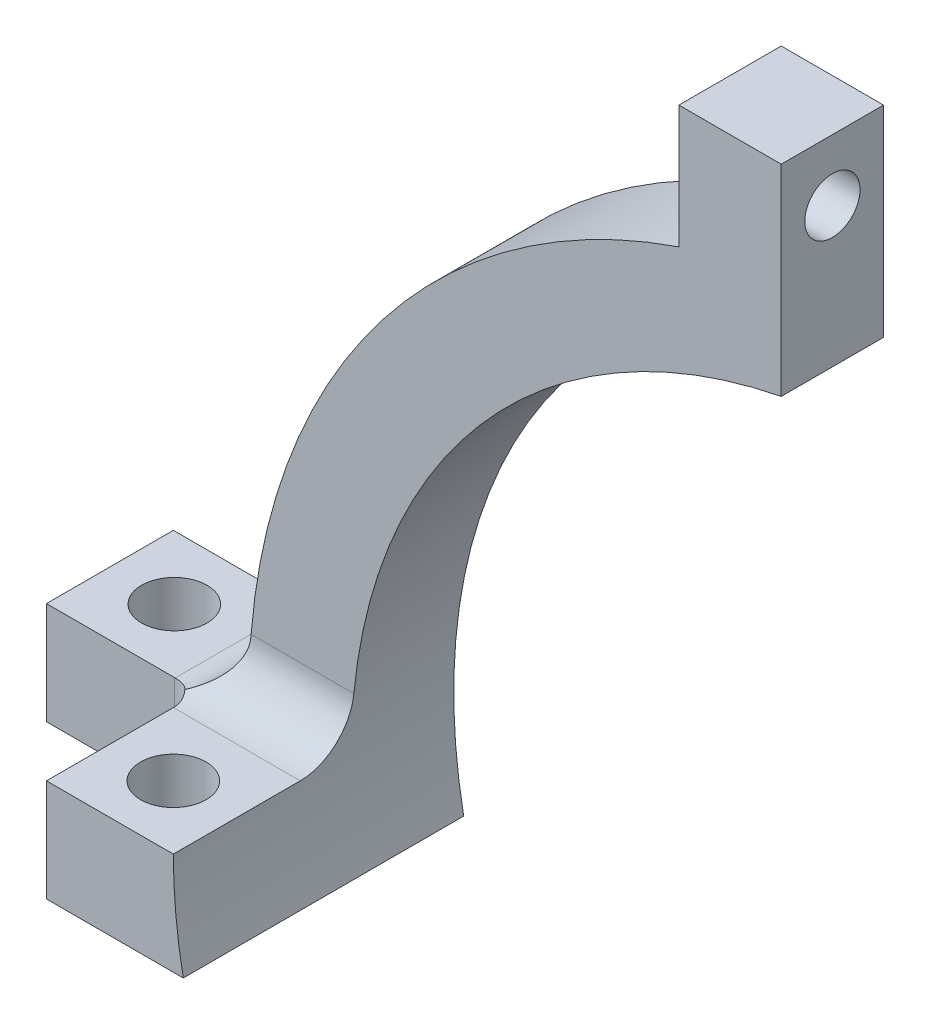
ISO-10303-21;
HEADER;
FILE_DESCRIPTION(('STEP AP214'),'2;1');
FILE_NAME('part.step','',(''),(''),'','','');
FILE_SCHEMA(('AUTOMOTIVE_DESIGN { 1 0 10303 214 1 1 1 1 }'));
ENDSEC;
DATA;
#1=APPLICATION_CONTEXT('core data for automotive mechanical design processes');
#2=APPLICATION_PROTOCOL_DEFINITION('international standard','automotive_design',2000,#1);
#3=PRODUCT_CONTEXT('',#1,'mechanical');
#4=PRODUCT('Part','Part','',(#3));
#5=PRODUCT_RELATED_PRODUCT_CATEGORY('part','',(#4));
#6=PRODUCT_DEFINITION_FORMATION('','',#4);
#7=PRODUCT_DEFINITION_CONTEXT('part definition',#1,'design');
#8=PRODUCT_DEFINITION('design','',#6,#7);
#9=PRODUCT_DEFINITION_SHAPE('','',#8);
#10=(LENGTH_UNIT() NAMED_UNIT(*) SI_UNIT(.MILLI.,.METRE.));
#11=(NAMED_UNIT(*) PLANE_ANGLE_UNIT() SI_UNIT($,.RADIAN.));
#12=(NAMED_UNIT(*) SI_UNIT($,.STERADIAN.) SOLID_ANGLE_UNIT());
#13=UNCERTAINTY_MEASURE_WITH_UNIT(LENGTH_MEASURE(1.E-05),#10,'distance_accuracy_value','');
#14=(GEOMETRIC_REPRESENTATION_CONTEXT(3) GLOBAL_UNCERTAINTY_ASSIGNED_CONTEXT((#13)) GLOBAL_UNIT_ASSIGNED_CONTEXT((#10,
#11,#12)) REPRESENTATION_CONTEXT('',''));
#15=CARTESIAN_POINT('',(0.,0.,0.));
#16=DIRECTION('',(0.,0.,1.));
#17=DIRECTION('',(1.,0.,0.));
#18=AXIS2_PLACEMENT_3D('',#15,#16,#17);
#19=CARTESIAN_POINT('',(-8.7,5.,1.2));
#20=DIRECTION('',(0.,-1.,0.));
#21=DIRECTION('',(1.,0.,0.));
#22=AXIS2_PLACEMENT_3D('',#19,#20,#21);
#23=PLANE('',#22);
#24=CARTESIAN_POINT('',(1.9,5.,5.6));
#25=DIRECTION('',(0.,-1.,0.));
#26=DIRECTION('',(-1.,0.,0.));
#27=AXIS2_PLACEMENT_3D('',#24,#25,#26);
#28=CIRCLE('',#27,1.6);
#29=CARTESIAN_POINT('',(0.3,5.,5.6));
#30=VERTEX_POINT('',#29);
#31=EDGE_CURVE('E515',#30,#30,#28,.T.);
#32=ORIENTED_EDGE('',*,*,#31,.T.);
#33=EDGE_LOOP('',(#32));
#34=FACE_BOUND('',#33,.T.);
#35=DIRECTION('',(0.,0.,-1.));
#36=VECTOR('',#35,1.);
#37=CARTESIAN_POINT('',(-1.2,5.,8.7));
#38=LINE('',#37,#36);
#39=CARTESIAN_POINT('',(-1.2,5.,8.7));
#40=VERTEX_POINT('',#39);
#41=CARTESIAN_POINT('',(-1.2,5.,2.5));
#42=VERTEX_POINT('',#41);
#43=EDGE_CURVE('E174',#40,#42,#38,.T.);
#44=ORIENTED_EDGE('',*,*,#43,.F.);
#45=DIRECTION('',(-1.,0.,0.));
#46=VECTOR('',#45,1.);
#47=CARTESIAN_POINT('',(5.,5.,8.7));
#48=LINE('',#47,#46);
#49=CARTESIAN_POINT('',(5.,5.,8.7));
#50=VERTEX_POINT('',#49);
#51=EDGE_CURVE('E147',#50,#40,#48,.T.);
#52=ORIENTED_EDGE('',*,*,#51,.F.);
#53=DIRECTION('',(0.,0.,-1.));
#54=VECTOR('',#53,1.);
#55=CARTESIAN_POINT('',(5.,5.,8.7));
#56=LINE('',#55,#54);
#57=CARTESIAN_POINT('',(5.,5.,2.5));
#58=VERTEX_POINT('',#57);
#59=EDGE_CURVE('E161',#50,#58,#56,.T.);
#60=ORIENTED_EDGE('',*,*,#59,.T.);
#61=DIRECTION('',(-1.,0.,0.));
#62=VECTOR('',#61,1.);
#63=CARTESIAN_POINT('',(5.,5.,2.5));
#64=LINE('',#63,#62);
#65=EDGE_CURVE('E246',#42,#58,#64,.F.);
#66=ORIENTED_EDGE('',*,*,#65,.F.);
#67=EDGE_LOOP('',(#44,#52,#60,#66));
#68=FACE_BOUND('',#67,.T.);
#69=ADVANCED_FACE('F35',(#34,#68),#23,.F.);
#70=CARTESIAN_POINT('',(5.48529835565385,0.,-5.));
#71=DIRECTION('',(0.,1.,0.));
#72=DIRECTION('',(0.,0.,-1.));
#73=AXIS2_PLACEMENT_3D('',#70,#71,#72);
#74=PLANE('',#73);
#75=CARTESIAN_POINT('',(-5.55329308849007,0.,-1.9));
#76=DIRECTION('',(0.,-1.,0.));
#77=DIRECTION('',(0.,0.,-1.));
#78=AXIS2_PLACEMENT_3D('',#75,#76,#77);
#79=CIRCLE('',#78,1.6);
#80=CARTESIAN_POINT('',(-5.55329308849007,0.,-3.5));
#81=VERTEX_POINT('',#80);
#82=EDGE_CURVE('E521',#81,#81,#79,.F.);
#83=ORIENTED_EDGE('',*,*,#82,.T.);
#84=EDGE_LOOP('',(#83));
#85=FACE_BOUND('',#84,.T.);
#86=CARTESIAN_POINT('',(1.9,0.,5.6));
#87=DIRECTION('',(0.,-1.,0.));
#88=DIRECTION('',(0.,0.,-1.));
#89=AXIS2_PLACEMENT_3D('',#86,#87,#88);
#90=CIRCLE('',#89,1.6);
#91=CARTESIAN_POINT('',(1.9,0.,4.));
#92=VERTEX_POINT('',#91);
#93=EDGE_CURVE('E518',#92,#92,#90,.F.);
#94=ORIENTED_EDGE('',*,*,#93,.T.);
#95=EDGE_LOOP('',(#94));
#96=FACE_BOUND('',#95,.T.);
#97=DIRECTION('',(1.,0.,0.));
#98=VECTOR('',#97,1.);
#99=CARTESIAN_POINT('',(-8.7,0.,1.2));
#100=LINE('',#99,#98);
#101=CARTESIAN_POINT('',(-8.7,0.,1.2));
#102=VERTEX_POINT('',#101);
#103=CARTESIAN_POINT('',(-2.45,0.,1.2));
#104=VERTEX_POINT('',#103);
#105=EDGE_CURVE('E194',#102,#104,#100,.T.);
#106=ORIENTED_EDGE('',*,*,#105,.F.);
#107=DIRECTION('',(0.,0.,-1.));
#108=VECTOR('',#107,1.);
#109=CARTESIAN_POINT('',(-8.7,0.,1.2));
#110=LINE('',#109,#108);
#111=CARTESIAN_POINT('',(-8.7,0.,-5.));
#112=VERTEX_POINT('',#111);
#113=EDGE_CURVE('E180',#102,#112,#110,.T.);
#114=ORIENTED_EDGE('',*,*,#113,.T.);
#115=DIRECTION('',(1.,0.,0.));
#116=VECTOR('',#115,1.);
#117=CARTESIAN_POINT('',(5.48529835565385,0.,-5.));
#118=LINE('',#117,#116);
#119=CARTESIAN_POINT('',(5.48529835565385,0.,-5.));
#120=VERTEX_POINT('',#119);
#121=EDGE_CURVE('E198',#112,#120,#118,.T.);
#122=ORIENTED_EDGE('',*,*,#121,.T.);
#123=DIRECTION('',(0.,0.,1.));
#124=VECTOR('',#123,1.);
#125=CARTESIAN_POINT('',(5.48529835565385,0.,-5.));
#126=LINE('',#125,#124);
#127=CARTESIAN_POINT('',(5.48529835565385,0.,8.7));
#128=VERTEX_POINT('',#127);
#129=EDGE_CURVE('E167',#120,#128,#126,.T.);
#130=ORIENTED_EDGE('',*,*,#129,.T.);
#131=DIRECTION('',(1.,0.,0.));
#132=VECTOR('',#131,1.);
#133=CARTESIAN_POINT('',(-1.2,0.,8.7));
#134=LINE('',#133,#132);
#135=CARTESIAN_POINT('',(-1.2,0.,8.7));
#136=VERTEX_POINT('',#135);
#137=EDGE_CURVE('E144',#136,#128,#134,.T.);
#138=ORIENTED_EDGE('',*,*,#137,.F.);
#139=DIRECTION('',(0.,0.,-1.));
#140=VECTOR('',#139,1.);
#141=CARTESIAN_POINT('',(-1.2,0.,8.7));
#142=LINE('',#141,#140);
#143=CARTESIAN_POINT('',(-1.2,0.,2.45));
#144=VERTEX_POINT('',#143);
#145=EDGE_CURVE('E154',#136,#144,#142,.T.);
#146=ORIENTED_EDGE('',*,*,#145,.T.);
#147=CARTESIAN_POINT('',(-2.45,0.,2.45));
#148=DIRECTION('',(0.,-1.,0.));
#149=DIRECTION('',(0.,0.,-1.));
#150=AXIS2_PLACEMENT_3D('',#147,#148,#149);
#151=CIRCLE('',#150,1.25);
#152=EDGE_CURVE('E304',#104,#144,#151,.T.);
#153=ORIENTED_EDGE('',*,*,#152,.F.);
#154=EDGE_LOOP('',(#106,#114,#122,#130,#138,#146,#153));
#155=FACE_BOUND('',#154,.T.);
#156=ADVANCED_FACE('F164',(#85,#96,#155),#74,.F.);
#157=CARTESIAN_POINT('',(31.,5.,-5.));
#158=DIRECTION('',(0.,0.,1.));
#159=DIRECTION('',(-1.,0.,0.));
#160=AXIS2_PLACEMENT_3D('',#157,#158,#159);
#161=CYLINDRICAL_SURFACE('',#160,26.);
#162=ORIENTED_EDGE('',*,*,#129,.F.);
#163=CARTESIAN_POINT('',(31.,5.,-5.));
#164=DIRECTION('',(0.,0.,-1.));
#165=DIRECTION('',(1.,0.,0.));
#166=AXIS2_PLACEMENT_3D('',#163,#164,#165);
#167=CIRCLE('',#166,26.);
#168=CARTESIAN_POINT('',(26.,30.5147016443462,-5.));
#169=VERTEX_POINT('',#168);
#170=EDGE_CURVE('E200',#120,#169,#167,.T.);
#171=ORIENTED_EDGE('',*,*,#170,.T.);
#172=DIRECTION('',(0.,0.,1.));
#173=VECTOR('',#172,1.);
#174=CARTESIAN_POINT('',(26.,30.5147016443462,-5.));
#175=LINE('',#174,#173);
#176=CARTESIAN_POINT('',(26.,30.5147016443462,0.));
#177=VERTEX_POINT('',#176);
#178=EDGE_CURVE('E238',#169,#177,#175,.T.);
#179=ORIENTED_EDGE('',*,*,#178,.T.);
#180=CARTESIAN_POINT('',(31.,5.,0.));
#181=DIRECTION('',(0.,0.,-1.));
#182=DIRECTION('',(1.,0.,0.));
#183=AXIS2_PLACEMENT_3D('',#180,#181,#182);
#184=CIRCLE('',#183,26.);
#185=CARTESIAN_POINT('',(5.12047141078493,7.5,0.));
#186=VERTEX_POINT('',#185);
#187=EDGE_CURVE('E197',#186,#177,#184,.T.);
#188=ORIENTED_EDGE('',*,*,#187,.F.);
#189=CARTESIAN_POINT('',(5.,5.,2.5));
#190=CARTESIAN_POINT('',(5.00000212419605,4.99999326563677,2.42968988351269));
#191=CARTESIAN_POINT('',(5.00000005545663,5.00296608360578,2.35938296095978));
#192=CARTESIAN_POINT('',(5.00000298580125,5.0148187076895,2.21927203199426));
#193=CARTESIAN_POINT('',(5.00000798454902,5.02369823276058,2.14946800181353));
#194=CARTESIAN_POINT('',(5.00004048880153,5.04730343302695,2.01090385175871));
#195=CARTESIAN_POINT('',(5.00006797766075,5.06202478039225,1.94214299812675));
#196=CARTESIAN_POINT('',(5.00017577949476,5.09719420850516,1.80612252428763));
#197=CARTESIAN_POINT('',(5.00025609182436,5.11764221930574,1.73886288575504));
#198=CARTESIAN_POINT('',(5.00063315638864,5.1874113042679,1.53998405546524));
#199=CARTESIAN_POINT('',(5.00106599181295,5.24516696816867,1.41120926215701));
#200=CARTESIAN_POINT('',(5.002709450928,5.38143641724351,1.16528046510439));
#201=CARTESIAN_POINT('',(5.00391993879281,5.45994657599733,1.04812443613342));
#202=CARTESIAN_POINT('',(5.0076193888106,5.63547888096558,0.828688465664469));
#203=CARTESIAN_POINT('',(5.01010784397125,5.73249367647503,0.726402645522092));
#204=CARTESIAN_POINT('',(5.01686943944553,5.94229278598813,0.539570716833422));
#205=CARTESIAN_POINT('',(5.02114285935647,6.05507956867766,0.455027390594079));
#206=CARTESIAN_POINT('',(5.03189730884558,6.29297586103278,0.306200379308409));
#207=CARTESIAN_POINT('',(5.0383751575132,6.41806743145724,0.241887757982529));
#208=CARTESIAN_POINT('',(5.05382240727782,6.67709758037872,0.135169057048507));
#209=CARTESIAN_POINT('',(5.06279050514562,6.8110315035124,0.0927515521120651));
#210=CARTESIAN_POINT('',(5.07984743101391,7.03813387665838,0.041269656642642));
#211=CARTESIAN_POINT('',(5.08722724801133,7.12995549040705,0.0257950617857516));
#212=CARTESIAN_POINT('',(5.10305733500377,7.31452290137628,0.00516119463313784));
#213=CARTESIAN_POINT('',(5.11150602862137,7.40726715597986,-1.30842178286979E-05));
#214=CARTESIAN_POINT('',(5.12047141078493,7.5,0.));
#215=B_SPLINE_CURVE_WITH_KNOTS('',3,(#189,#190,#191,#192,#193,#194,#195,#196,#197,#198,#199,
#200,#201,#202,#203,#204,#205,#206,#207,#208,#209,#210,#211,#212,#213,#214),.UNSPECIFIED.,.F.,
.F.,(4,2,2,2,2,2,2,2,2,2,2,2,4),(0.,0.210861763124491,0.421713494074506,0.632409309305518,
0.843102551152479,1.26432167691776,1.68546725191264,2.10644587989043,2.52749047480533,
2.94793007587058,3.36815006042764,3.64783239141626,3.92710695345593),.UNSPECIFIED.);
#216=EDGE_CURVE('E290',#58,#186,#215,.T.);
#217=ORIENTED_EDGE('',*,*,#216,.F.);
#218=ORIENTED_EDGE('',*,*,#59,.F.);
#219=CARTESIAN_POINT('',(31.,5.,8.7));
#220=DIRECTION('',(0.,0.,-1.));
#221=DIRECTION('',(1.,0.,0.));
#222=AXIS2_PLACEMENT_3D('',#219,#220,#221);
#223=CIRCLE('',#222,26.);
#224=EDGE_CURVE('E168',#128,#50,#223,.T.);
#225=ORIENTED_EDGE('',*,*,#224,.F.);
#226=EDGE_LOOP('',(#162,#171,#179,#188,#217,#218,#225));
#227=FACE_BOUND('',#226,.T.);
#228=ADVANCED_FACE('F285',(#227),#161,.F.);
#229=CARTESIAN_POINT('',(26.,40.3428015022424,-5.));
#230=DIRECTION('',(-1.,0.,0.));
#231=DIRECTION('',(0.,-1.,0.));
#232=AXIS2_PLACEMENT_3D('',#229,#230,#231);
#233=PLANE('',#232);
#234=CARTESIAN_POINT('',(26.,37.3428015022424,-2.5));
#235=DIRECTION('',(1.,0.,0.));
#236=DIRECTION('',(0.,-1.,0.));
#237=AXIS2_PLACEMENT_3D('',#234,#235,#236);
#238=CIRCLE('',#237,1.35);
#239=CARTESIAN_POINT('',(26.,35.9928015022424,-2.5));
#240=VERTEX_POINT('',#239);
#241=EDGE_CURVE('E301',#240,#240,#238,.F.);
#242=ORIENTED_EDGE('',*,*,#241,.T.);
#243=EDGE_LOOP('',(#242));
#244=FACE_BOUND('',#243,.T.);
#245=DIRECTION('',(0.,1.,0.));
#246=VECTOR('',#245,1.);
#247=CARTESIAN_POINT('',(26.,40.3428015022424,0.));
#248=LINE('',#247,#246);
#249=CARTESIAN_POINT('',(26.,40.3428015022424,0.));
#250=VERTEX_POINT('',#249);
#251=EDGE_CURVE('E219',#177,#250,#248,.T.);
#252=ORIENTED_EDGE('',*,*,#251,.F.);
#253=ORIENTED_EDGE('',*,*,#178,.F.);
#254=DIRECTION('',(0.,1.,0.));
#255=VECTOR('',#254,1.);
#256=CARTESIAN_POINT('',(26.,40.3428015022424,-5.));
#257=LINE('',#256,#255);
#258=CARTESIAN_POINT('',(26.,40.3428015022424,-5.));
#259=VERTEX_POINT('',#258);
#260=EDGE_CURVE('E204',#169,#259,#257,.T.);
#261=ORIENTED_EDGE('',*,*,#260,.T.);
#262=DIRECTION('',(0.,0.,1.));
#263=VECTOR('',#262,1.);
#264=CARTESIAN_POINT('',(26.,40.3428015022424,-5.));
#265=LINE('',#264,#263);
#266=EDGE_CURVE('E235',#259,#250,#265,.T.);
#267=ORIENTED_EDGE('',*,*,#266,.T.);
#268=EDGE_LOOP('',(#252,#253,#261,#267));
#269=FACE_BOUND('',#268,.T.);
#270=ADVANCED_FACE('F281',(#244,#269),#233,.F.);
#271=CARTESIAN_POINT('',(26.,40.3428015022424,-5.));
#272=DIRECTION('',(0.,-1.,0.));
#273=DIRECTION('',(0.,0.,1.));
#274=AXIS2_PLACEMENT_3D('',#271,#272,#273);
#275=PLANE('',#274);
#276=DIRECTION('',(-1.,0.,0.));
#277=VECTOR('',#276,1.);
#278=CARTESIAN_POINT('',(26.,40.3428015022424,0.));
#279=LINE('',#278,#277);
#280=CARTESIAN_POINT('',(21.,40.3428015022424,0.));
#281=VERTEX_POINT('',#280);
#282=EDGE_CURVE('E222',#250,#281,#279,.T.);
#283=ORIENTED_EDGE('',*,*,#282,.F.);
#284=ORIENTED_EDGE('',*,*,#266,.F.);
#285=DIRECTION('',(-1.,0.,0.));
#286=VECTOR('',#285,1.);
#287=CARTESIAN_POINT('',(26.,40.3428015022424,-5.));
#288=LINE('',#287,#286);
#289=CARTESIAN_POINT('',(21.,40.3428015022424,-5.));
#290=VERTEX_POINT('',#289);
#291=EDGE_CURVE('E207',#259,#290,#288,.T.);
#292=ORIENTED_EDGE('',*,*,#291,.T.);
#293=DIRECTION('',(0.,0.,1.));
#294=VECTOR('',#293,1.);
#295=CARTESIAN_POINT('',(21.,40.3428015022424,-5.));
#296=LINE('',#295,#294);
#297=EDGE_CURVE('E232',#290,#281,#296,.T.);
#298=ORIENTED_EDGE('',*,*,#297,.T.);
#299=EDGE_LOOP('',(#283,#284,#292,#298));
#300=FACE_BOUND('',#299,.T.);
#301=ADVANCED_FACE('F277',(#300),#275,.F.);
#302=CARTESIAN_POINT('',(21.,40.3428015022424,-5.));
#303=DIRECTION('',(1.,0.,0.));
#304=DIRECTION('',(0.,0.,1.));
#305=AXIS2_PLACEMENT_3D('',#302,#303,#304);
#306=PLANE('',#305);
#307=CARTESIAN_POINT('',(21.,37.3428015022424,-2.5));
#308=DIRECTION('',(1.,0.,0.));
#309=DIRECTION('',(0.,0.,-1.));
#310=AXIS2_PLACEMENT_3D('',#307,#308,#309);
#311=CIRCLE('',#310,1.35);
#312=CARTESIAN_POINT('',(21.,37.3428015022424,-3.85));
#313=VERTEX_POINT('',#312);
#314=EDGE_CURVE('E526',#313,#313,#311,.T.);
#315=ORIENTED_EDGE('',*,*,#314,.T.);
#316=EDGE_LOOP('',(#315));
#317=FACE_BOUND('',#316,.T.);
#318=DIRECTION('',(0.,-1.,0.));
#319=VECTOR('',#318,1.);
#320=CARTESIAN_POINT('',(21.,40.3428015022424,0.));
#321=LINE('',#320,#319);
#322=CARTESIAN_POINT('',(21.,34.3428015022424,0.));
#323=VERTEX_POINT('',#322);
#324=EDGE_CURVE('E225',#281,#323,#321,.T.);
#325=ORIENTED_EDGE('',*,*,#324,.F.);
#326=ORIENTED_EDGE('',*,*,#297,.F.);
#327=DIRECTION('',(0.,-1.,0.));
#328=VECTOR('',#327,1.);
#329=CARTESIAN_POINT('',(21.,40.3428015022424,-5.));
#330=LINE('',#329,#328);
#331=CARTESIAN_POINT('',(21.,34.3428015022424,-5.));
#332=VERTEX_POINT('',#331);
#333=EDGE_CURVE('E210',#290,#332,#330,.T.);
#334=ORIENTED_EDGE('',*,*,#333,.T.);
#335=DIRECTION('',(0.,0.,1.));
#336=VECTOR('',#335,1.);
#337=CARTESIAN_POINT('',(21.,34.3428015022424,-5.));
#338=LINE('',#337,#336);
#339=EDGE_CURVE('E216',#332,#323,#338,.T.);
#340=ORIENTED_EDGE('',*,*,#339,.T.);
#341=EDGE_LOOP('',(#325,#326,#334,#340));
#342=FACE_BOUND('',#341,.T.);
#343=ADVANCED_FACE('F271',(#317,#342),#306,.F.);
#344=CARTESIAN_POINT('',(31.,5.,-5.));
#345=DIRECTION('',(0.,0.,1.));
#346=DIRECTION('',(-1.,0.,0.));
#347=AXIS2_PLACEMENT_3D('',#344,#345,#346);
#348=CYLINDRICAL_SURFACE('',#347,31.);
#349=CARTESIAN_POINT('',(0.100970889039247,7.5,0.));
#350=CARTESIAN_POINT('',(0.0984523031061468,7.46886963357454,1.22798164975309E-07));
#351=CARTESIAN_POINT('',(0.0959823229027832,7.43775718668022,0.000581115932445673));
#352=CARTESIAN_POINT('',(0.0911395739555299,7.37556813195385,0.00290484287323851));
#353=CARTESIAN_POINT('',(0.0887668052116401,7.34449152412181,0.00464757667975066));
#354=CARTESIAN_POINT('',(0.0864426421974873,7.3134328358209,0.00697118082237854));
#355=B_SPLINE_CURVE_WITH_KNOTS('',3,(#349,#350,#351,#352,#353,#354),.UNSPECIFIED.,.F.,.F.,(4,2,
4),(0.,0.0936472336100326,0.187294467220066),.UNSPECIFIED.);
#356=CARTESIAN_POINT('',(0.100970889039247,7.5,0.));
#357=VERTEX_POINT('',#356);
#358=CARTESIAN_POINT('',(0.0864426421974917,7.3134328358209,0.00697118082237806));
#359=VERTEX_POINT('',#358);
#360=EDGE_CURVE('E252',#357,#359,#355,.T.);
#361=ORIENTED_EDGE('',*,*,#360,.F.);
#362=CARTESIAN_POINT('',(31.,5.,0.));
#363=DIRECTION('',(0.,0.,1.));
#364=DIRECTION('',(-1.,0.,0.));
#365=AXIS2_PLACEMENT_3D('',#362,#363,#364);
#366=CIRCLE('',#365,31.);
#367=EDGE_CURVE('E201',#323,#357,#366,.T.);
#368=ORIENTED_EDGE('',*,*,#367,.F.);
#369=ORIENTED_EDGE('',*,*,#339,.F.);
#370=CARTESIAN_POINT('',(31.,5.,-5.));
#371=DIRECTION('',(0.,0.,1.));
#372=DIRECTION('',(-1.,0.,0.));
#373=AXIS2_PLACEMENT_3D('',#370,#371,#372);
#374=CIRCLE('',#373,31.);
#375=CARTESIAN_POINT('',(0.0864426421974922,7.3134328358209,-5.));
#376=VERTEX_POINT('',#375);
#377=EDGE_CURVE('E213',#332,#376,#374,.T.);
#378=ORIENTED_EDGE('',*,*,#377,.T.);
#379=DIRECTION('',(0.,0.,1.));
#380=VECTOR('',#379,1.);
#381=CARTESIAN_POINT('',(0.0864426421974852,7.3134328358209,-5.));
#382=LINE('',#381,#380);
#383=EDGE_CURVE('E249',#359,#376,#382,.F.);
#384=ORIENTED_EDGE('',*,*,#383,.F.);
#385=EDGE_LOOP('',(#361,#368,#369,#378,#384));
#386=FACE_BOUND('',#385,.T.);
#387=ADVANCED_FACE('F265',(#386),#348,.T.);
#388=CARTESIAN_POINT('',(31.,5.,-5.));
#389=DIRECTION('',(0.,0.,-1.));
#390=DIRECTION('',(1.,0.,0.));
#391=AXIS2_PLACEMENT_3D('',#388,#389,#390);
#392=PLANE('',#391);
#393=ORIENTED_EDGE('',*,*,#377,.F.);
#394=ORIENTED_EDGE('',*,*,#333,.F.);
#395=ORIENTED_EDGE('',*,*,#291,.F.);
#396=ORIENTED_EDGE('',*,*,#260,.F.);
#397=ORIENTED_EDGE('',*,*,#170,.F.);
#398=ORIENTED_EDGE('',*,*,#121,.F.);
#399=DIRECTION('',(0.,1.,0.));
#400=VECTOR('',#399,1.);
#401=CARTESIAN_POINT('',(-8.7,0.,-5.));
#402=LINE('',#401,#400);
#403=CARTESIAN_POINT('',(-8.7,5.,-5.));
#404=VERTEX_POINT('',#403);
#405=EDGE_CURVE('E183',#112,#404,#402,.T.);
#406=ORIENTED_EDGE('',*,*,#405,.T.);
#407=DIRECTION('',(1.,0.,0.));
#408=VECTOR('',#407,1.);
#409=CARTESIAN_POINT('',(-8.7,5.,-5.));
#410=LINE('',#409,#408);
#411=CARTESIAN_POINT('',(-2.40658617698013,5.,-5.));
#412=VERTEX_POINT('',#411);
#413=EDGE_CURVE('E191',#404,#412,#410,.T.);
#414=ORIENTED_EDGE('',*,*,#413,.T.);
#415=CARTESIAN_POINT('',(-2.40658617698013,7.5,-5.));
#416=DIRECTION('',(0.,0.,1.));
#417=DIRECTION('',(1.,0.,0.));
#418=AXIS2_PLACEMENT_3D('',#415,#416,#417);
#419=CIRCLE('',#418,2.5);
#420=EDGE_CURVE('E296',#376,#412,#419,.F.);
#421=ORIENTED_EDGE('',*,*,#420,.F.);
#422=EDGE_LOOP('',(#393,#394,#395,#396,#397,#398,#406,#414,#421));
#423=FACE_BOUND('',#422,.T.);
#424=ADVANCED_FACE('F270',(#423),#392,.T.);
#425=CARTESIAN_POINT('',(31.,5.,0.));
#426=DIRECTION('',(0.,0.,-1.));
#427=DIRECTION('',(1.,0.,0.));
#428=AXIS2_PLACEMENT_3D('',#425,#426,#427);
#429=PLANE('',#428);
#430=ORIENTED_EDGE('',*,*,#187,.T.);
#431=ORIENTED_EDGE('',*,*,#251,.T.);
#432=ORIENTED_EDGE('',*,*,#282,.T.);
#433=ORIENTED_EDGE('',*,*,#324,.T.);
#434=ORIENTED_EDGE('',*,*,#367,.T.);
#435=DIRECTION('',(-1.,0.,0.));
#436=VECTOR('',#435,1.);
#437=CARTESIAN_POINT('',(0.,7.5,0.));
#438=LINE('',#437,#436);
#439=EDGE_CURVE('E242',#186,#357,#438,.T.);
#440=ORIENTED_EDGE('',*,*,#439,.F.);
#441=EDGE_LOOP('',(#430,#431,#432,#433,#434,#440));
#442=FACE_BOUND('',#441,.T.);
#443=ADVANCED_FACE('F273',(#442),#429,.F.);
#444=CARTESIAN_POINT('',(-8.7,0.,1.2));
#445=DIRECTION('',(0.,0.,-1.));
#446=DIRECTION('',(1.,0.,0.));
#447=AXIS2_PLACEMENT_3D('',#444,#445,#446);
#448=PLANE('',#447);
#449=DIRECTION('',(1.,0.,0.));
#450=VECTOR('',#449,1.);
#451=CARTESIAN_POINT('',(-8.7,5.,1.2));
#452=LINE('',#451,#450);
#453=CARTESIAN_POINT('',(-8.7,5.,1.2));
#454=VERTEX_POINT('',#453);
#455=CARTESIAN_POINT('',(-2.45,5.,1.2));
#456=VERTEX_POINT('',#455);
#457=EDGE_CURVE('E188',#454,#456,#452,.T.);
#458=ORIENTED_EDGE('',*,*,#457,.F.);
#459=DIRECTION('',(0.,-1.,0.));
#460=VECTOR('',#459,1.);
#461=CARTESIAN_POINT('',(-8.7,0.,1.2));
#462=LINE('',#461,#460);
#463=EDGE_CURVE('E176',#454,#102,#462,.T.);
#464=ORIENTED_EDGE('',*,*,#463,.T.);
#465=ORIENTED_EDGE('',*,*,#105,.T.);
#466=DIRECTION('',(0.,-1.,0.));
#467=VECTOR('',#466,1.);
#468=CARTESIAN_POINT('',(-2.45,0.,1.2));
#469=LINE('',#468,#467);
#470=EDGE_CURVE('E299',#456,#104,#469,.T.);
#471=ORIENTED_EDGE('',*,*,#470,.F.);
#472=EDGE_LOOP('',(#458,#464,#465,#471));
#473=FACE_BOUND('',#472,.T.);
#474=ADVANCED_FACE('F337',(#473),#448,.F.);
#475=CARTESIAN_POINT('',(-5.55329308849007,5.,-1.9));
#476=DIRECTION('',(0.,-1.,0.));
#477=DIRECTION('',(-1.,0.,0.));
#478=AXIS2_PLACEMENT_3D('',#475,#476,#477);
#479=CIRCLE('',#478,1.6);
#480=CARTESIAN_POINT('',(-7.15329308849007,5.,-1.9));
#481=VERTEX_POINT('',#480);
#482=EDGE_CURVE('E348',#481,#481,#479,.T.);
#483=ORIENTED_EDGE('',*,*,#482,.T.);
#484=EDGE_LOOP('',(#483));
#485=FACE_BOUND('',#484,.T.);
#486=ORIENTED_EDGE('',*,*,#413,.F.);
#487=DIRECTION('',(0.,0.,1.));
#488=VECTOR('',#487,1.);
#489=CARTESIAN_POINT('',(-8.7,5.,1.2));
#490=LINE('',#489,#488);
#491=EDGE_CURVE('E186',#404,#454,#490,.T.);
#492=ORIENTED_EDGE('',*,*,#491,.T.);
#493=ORIENTED_EDGE('',*,*,#457,.T.);
#494=CARTESIAN_POINT('',(-2.45,5.,2.45));
#495=DIRECTION('',(0.,1.,0.));
#496=DIRECTION('',(1.,0.,0.));
#497=AXIS2_PLACEMENT_3D('',#494,#495,#496);
#498=CIRCLE('',#497,1.25);
#499=CARTESIAN_POINT('',(-2.40658617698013,5.,1.20075413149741));
#500=VERTEX_POINT('',#499);
#501=EDGE_CURVE('E11',#500,#456,#498,.T.);
#502=ORIENTED_EDGE('',*,*,#501,.F.);
#503=DIRECTION('',(0.,0.,-1.));
#504=VECTOR('',#503,1.);
#505=CARTESIAN_POINT('',(-2.40658617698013,5.,0.));
#506=LINE('',#505,#504);
#507=EDGE_CURVE('E244',#412,#500,#506,.F.);
#508=ORIENTED_EDGE('',*,*,#507,.F.);
#509=EDGE_LOOP('',(#486,#492,#493,#502,#508));
#510=FACE_BOUND('',#509,.T.);
#511=ADVANCED_FACE('F326',(#485,#510),#23,.F.);
#512=CARTESIAN_POINT('',(-8.7,0.,0.));
#513=DIRECTION('',(1.,0.,0.));
#514=DIRECTION('',(0.,1.,0.));
#515=AXIS2_PLACEMENT_3D('',#512,#513,#514);
#516=PLANE('',#515);
#517=ORIENTED_EDGE('',*,*,#463,.F.);
#518=ORIENTED_EDGE('',*,*,#491,.F.);
#519=ORIENTED_EDGE('',*,*,#405,.F.);
#520=ORIENTED_EDGE('',*,*,#113,.F.);
#521=EDGE_LOOP('',(#517,#518,#519,#520));
#522=FACE_BOUND('',#521,.T.);
#523=ADVANCED_FACE('F336',(#522),#516,.F.);
#524=CARTESIAN_POINT('',(-1.2,5.,8.7));
#525=DIRECTION('',(-1.,0.,0.));
#526=DIRECTION('',(0.,-1.,0.));
#527=AXIS2_PLACEMENT_3D('',#524,#525,#526);
#528=PLANE('',#527);
#529=ORIENTED_EDGE('',*,*,#145,.F.);
#530=DIRECTION('',(0.,-1.,0.));
#531=VECTOR('',#530,1.);
#532=CARTESIAN_POINT('',(-1.2,5.,8.7));
#533=LINE('',#532,#531);
#534=EDGE_CURVE('E140',#40,#136,#533,.T.);
#535=ORIENTED_EDGE('',*,*,#534,.F.);
#536=ORIENTED_EDGE('',*,*,#43,.T.);
#537=CARTESIAN_POINT('',(-1.2,7.5,2.5));
#538=DIRECTION('',(1.,0.,0.));
#539=DIRECTION('',(0.,-1.,0.));
#540=AXIS2_PLACEMENT_3D('',#537,#538,#539);
#541=CIRCLE('',#540,2.5);
#542=CARTESIAN_POINT('',(-1.2,5.00050005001,2.45));
#543=VERTEX_POINT('',#542);
#544=EDGE_CURVE('E260',#543,#42,#541,.F.);
#545=ORIENTED_EDGE('',*,*,#544,.F.);
#546=DIRECTION('',(0.,-1.,0.));
#547=VECTOR('',#546,1.);
#548=CARTESIAN_POINT('',(-1.2,5.,2.45));
#549=LINE('',#548,#547);
#550=EDGE_CURVE('E157',#144,#543,#549,.F.);
#551=ORIENTED_EDGE('',*,*,#550,.F.);
#552=EDGE_LOOP('',(#529,#535,#536,#545,#551));
#553=FACE_BOUND('',#552,.T.);
#554=ADVANCED_FACE('F155',(#553),#528,.T.);
#555=CARTESIAN_POINT('',(31.,5.,8.7));
#556=DIRECTION('',(0.,0.,-1.));
#557=DIRECTION('',(1.,0.,0.));
#558=AXIS2_PLACEMENT_3D('',#555,#556,#557);
#559=PLANE('',#558);
#560=ORIENTED_EDGE('',*,*,#534,.T.);
#561=ORIENTED_EDGE('',*,*,#137,.T.);
#562=ORIENTED_EDGE('',*,*,#224,.T.);
#563=ORIENTED_EDGE('',*,*,#51,.T.);
#564=EDGE_LOOP('',(#560,#561,#562,#563));
#565=FACE_BOUND('',#564,.T.);
#566=ADVANCED_FACE('F142',(#565),#559,.F.);
#567=CARTESIAN_POINT('',(-2.40658617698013,7.5,-5.));
#568=DIRECTION('',(0.,0.,1.));
#569=DIRECTION('',(-1.,0.,0.));
#570=AXIS2_PLACEMENT_3D('',#567,#568,#569);
#571=CYLINDRICAL_SURFACE('',#570,2.5);
#572=ORIENTED_EDGE('',*,*,#383,.T.);
#573=ORIENTED_EDGE('',*,*,#420,.T.);
#574=ORIENTED_EDGE('',*,*,#507,.T.);
#575=CARTESIAN_POINT('',(-1.52064453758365,5.16224308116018,1.61405836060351));
#576=CARTESIAN_POINT('',(-1.56683728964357,5.14469403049,1.56267075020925));
#577=CARTESIAN_POINT('',(-1.61736785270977,5.12715019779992,1.51509412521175));
#578=CARTESIAN_POINT('',(-1.72620746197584,5.09369882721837,1.42849533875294));
#579=CARTESIAN_POINT('',(-1.78455508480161,5.0778001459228,1.38951831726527));
#580=CARTESIAN_POINT('',(-1.90782170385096,5.04943704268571,1.32149875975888));
#581=CARTESIAN_POINT('',(-1.97276023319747,5.03698326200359,1.29248694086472));
#582=CARTESIAN_POINT('',(-2.10712408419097,5.0170801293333,1.24585887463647));
#583=CARTESIAN_POINT('',(-2.17653004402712,5.00961059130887,1.22819667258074));
#584=CARTESIAN_POINT('',(-2.27338349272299,5.00340954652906,1.21224968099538));
#585=CARTESIAN_POINT('',(-2.29989751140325,5.00213517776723,1.20875608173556));
#586=CARTESIAN_POINT('',(-2.35312162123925,5.00043038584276,1.20347374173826));
#587=CARTESIAN_POINT('',(-2.37983171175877,4.99999995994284,1.20168499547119));
#588=CARTESIAN_POINT('',(-2.40658617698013,4.99999999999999,1.20075413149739));
#589=B_SPLINE_CURVE_WITH_KNOTS('',3,(#575,#576,#577,#578,#579,#580,#581,#582,#583,#584,#585,
#586,#587,#588),.UNSPECIFIED.,.F.,.F.,(4,2,2,2,2,2,4),(0.,0.213752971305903,0.428602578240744,
0.644108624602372,0.85873649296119,0.939002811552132,1.01926886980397),.UNSPECIFIED.);
#590=CARTESIAN_POINT('',(-1.52064453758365,5.16224308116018,1.61405836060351));
#591=VERTEX_POINT('',#590);
#592=EDGE_CURVE('E44',#591,#500,#589,.T.);
#593=ORIENTED_EDGE('',*,*,#592,.F.);
#594=CARTESIAN_POINT('',(-2.40658617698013,7.5,2.5));
#595=DIRECTION('',(-0.707106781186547,0.,-0.707106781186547));
#596=DIRECTION('',(0.707106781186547,0.,-0.707106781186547));
#597=AXIS2_PLACEMENT_3D('',#594,#595,#596);
#598=ELLIPSE('',#597,3.53553390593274,2.5);
#599=EDGE_CURVE('E151',#591,#359,#598,.F.);
#600=ORIENTED_EDGE('',*,*,#599,.T.);
#601=EDGE_LOOP('',(#572,#573,#574,#593,#600));
#602=FACE_BOUND('',#601,.T.);
#603=ADVANCED_FACE('F312',(#602),#571,.F.);
#604=CARTESIAN_POINT('',(31.,7.5,2.5));
#605=DIRECTION('',(1.,0.,0.));
#606=DIRECTION('',(0.,1.,0.));
#607=AXIS2_PLACEMENT_3D('',#604,#605,#606);
#608=CYLINDRICAL_SURFACE('',#607,2.5);
#609=ORIENTED_EDGE('',*,*,#216,.T.);
#610=ORIENTED_EDGE('',*,*,#439,.T.);
#611=ORIENTED_EDGE('',*,*,#360,.T.);
#612=ORIENTED_EDGE('',*,*,#599,.F.);
#613=CARTESIAN_POINT('',(-1.2,5.00050005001,2.45));
#614=CARTESIAN_POINT('',(-1.19999839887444,5.00116016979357,2.41683315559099));
#615=CARTESIAN_POINT('',(-1.20132098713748,5.00248752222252,2.38369813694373));
#616=CARTESIAN_POINT('',(-1.20657790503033,5.00643514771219,2.31772676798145));
#617=CARTESIAN_POINT('',(-1.21051116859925,5.0090548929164,2.28489030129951));
#618=CARTESIAN_POINT('',(-1.22612731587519,5.01876326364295,2.18742977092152));
#619=CARTESIAN_POINT('',(-1.24162728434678,5.02770766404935,2.12355611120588));
#620=CARTESIAN_POINT('',(-1.28206724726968,5.04974225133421,1.99980221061));
#621=CARTESIAN_POINT('',(-1.30699557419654,5.06282731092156,1.93991714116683));
#622=CARTESIAN_POINT('',(-1.36540034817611,5.09204532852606,1.82527887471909));
#623=CARTESIAN_POINT('',(-1.39887502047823,5.10817765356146,1.77052461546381));
#624=CARTESIAN_POINT('',(-1.44929983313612,5.13117668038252,1.70059450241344));
#625=CARTESIAN_POINT('',(-1.46295000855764,5.13729440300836,1.68270700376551));
#626=CARTESIAN_POINT('',(-1.49113554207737,5.14967286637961,1.64776537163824));
#627=CARTESIAN_POINT('',(-1.50566887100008,5.15593326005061,1.63070947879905));
#628=CARTESIAN_POINT('',(-1.52064453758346,5.16224308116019,1.61405836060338));
#629=B_SPLINE_CURVE_WITH_KNOTS('',3,(#613,#614,#615,#616,#617,#618,#619,#620,#621,#622,#623,
#624,#625,#626,#627,#628),.UNSPECIFIED.,.F.,.F.,(4,2,2,2,2,2,2,4),(0.,0.0994517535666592,
0.198862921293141,0.3968020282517,0.594496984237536,0.792150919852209,0.862081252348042,
0.931856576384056),.UNSPECIFIED.);
#630=EDGE_CURVE('E54',#543,#591,#629,.T.);
#631=ORIENTED_EDGE('',*,*,#630,.F.);
#632=ORIENTED_EDGE('',*,*,#544,.T.);
#633=ORIENTED_EDGE('',*,*,#65,.T.);
#634=EDGE_LOOP('',(#609,#610,#611,#612,#631,#632,#633));
#635=FACE_BOUND('',#634,.T.);
#636=ADVANCED_FACE('F262',(#635),#608,.F.);
#637=CARTESIAN_POINT('',(26.001,37.3428015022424,-2.5));
#638=DIRECTION('',(-1.,0.,0.));
#639=DIRECTION('',(0.,0.,-1.));
#640=AXIS2_PLACEMENT_3D('',#637,#638,#639);
#641=CYLINDRICAL_SURFACE('',#640,1.35);
#642=ORIENTED_EDGE('',*,*,#314,.F.);
#643=EDGE_LOOP('',(#642));
#644=FACE_BOUND('',#643,.T.);
#645=ORIENTED_EDGE('',*,*,#241,.F.);
#646=EDGE_LOOP('',(#645));
#647=FACE_BOUND('',#646,.T.);
#648=ADVANCED_FACE('F320',(#644,#647),#641,.F.);
#649=CARTESIAN_POINT('',(-5.55329308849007,-0.00100000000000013,-1.9));
#650=DIRECTION('',(0.,1.,0.));
#651=DIRECTION('',(-1.,0.,0.));
#652=AXIS2_PLACEMENT_3D('',#649,#650,#651);
#653=CYLINDRICAL_SURFACE('',#652,1.6);
#654=ORIENTED_EDGE('',*,*,#482,.F.);
#655=EDGE_LOOP('',(#654));
#656=FACE_BOUND('',#655,.T.);
#657=ORIENTED_EDGE('',*,*,#82,.F.);
#658=EDGE_LOOP('',(#657));
#659=FACE_BOUND('',#658,.T.);
#660=ADVANCED_FACE('F482',(#656,#659),#653,.F.);
#661=CARTESIAN_POINT('',(1.9,-0.00100000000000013,5.6));
#662=DIRECTION('',(0.,1.,0.));
#663=DIRECTION('',(-1.,0.,0.));
#664=AXIS2_PLACEMENT_3D('',#661,#662,#663);
#665=CYLINDRICAL_SURFACE('',#664,1.6);
#666=ORIENTED_EDGE('',*,*,#31,.F.);
#667=EDGE_LOOP('',(#666));
#668=FACE_BOUND('',#667,.T.);
#669=ORIENTED_EDGE('',*,*,#93,.F.);
#670=EDGE_LOOP('',(#669));
#671=FACE_BOUND('',#670,.T.);
#672=ADVANCED_FACE('F491',(#668,#671),#665,.F.);
#673=CARTESIAN_POINT('',(-2.45,0.,2.45));
#674=DIRECTION('',(0.,-1.,0.));
#675=DIRECTION('',(1.,0.,0.));
#676=AXIS2_PLACEMENT_3D('',#673,#674,#675);
#677=CYLINDRICAL_SURFACE('',#676,1.25);
#678=ORIENTED_EDGE('',*,*,#630,.T.);
#679=ORIENTED_EDGE('',*,*,#592,.T.);
#680=ORIENTED_EDGE('',*,*,#501,.T.);
#681=ORIENTED_EDGE('',*,*,#470,.T.);
#682=ORIENTED_EDGE('',*,*,#152,.T.);
#683=ORIENTED_EDGE('',*,*,#550,.T.);
#684=EDGE_LOOP('',(#678,#679,#680,#681,#682,#683));
#685=FACE_BOUND('',#684,.T.);
#686=ADVANCED_FACE('F37',(#685),#677,.F.);
#687=CLOSED_SHELL('',(#69,#156,#228,#270,#301,#343,#387,#424,#443,#474,#511,#523,#554,#566,#603,
#636,#648,#660,#672,#686));
#688=MANIFOLD_SOLID_BREP('B2',#687);
#689=ADVANCED_BREP_SHAPE_REPRESENTATION('',(#18,#688),#14);
#690=SHAPE_DEFINITION_REPRESENTATION(#9,#689);
ENDSEC;
END-ISO-10303-21;
